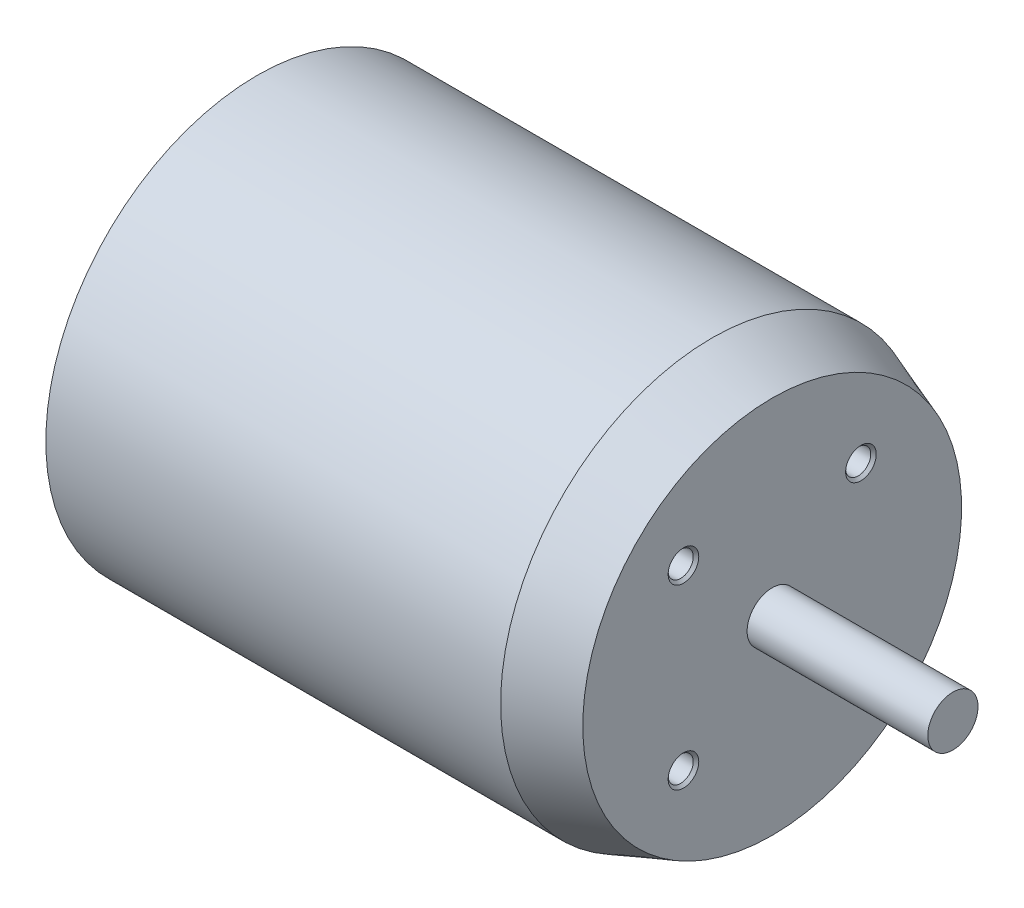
from build123d import *

# Parameters (mm, degrees)
R_P_TITION_CIRCULAIRE1_COUNT = 4


with BuildPart() as part:
    # Esquisse1 → R_volution1 (revolve)
    with BuildSketch(Plane.XY, mode=Mode.PRIVATE) as r_volution1_sk:
        Polygon((7, 5.5), (7, 21.05), (52.3, 21.05), (58.3, 18.866178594), (58.3, 2.5), (76.3, 2.5), (76.3, 0), (0, 0), (0, 5.5), align=None)
    revolve(r_volution1_sk.sketch.rotate(Axis((-55.117731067, 0, 0), (1, 0, 0)), 180), axis=Axis((-55.117731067, 0, 0), (1, 0, 0)))

    # Esquisse4 → Trou taraud_ M41 _position _ v_rifier (revolve, cut)
    with BuildSketch(Plane(origin=(58.3, 8.838834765, -8.838834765), x_dir=(0, 0, -1), z_dir=(0, 1, 0))):
        Polygon((0, 0), (0, 9.251075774), (1.25, 8.5), (1.25, 0.275), (1.525, 0), align=None)
    trou_taraud_m41_position_v_rifier = revolve(axis=Axis((64.65, 8.838834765, -8.838834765), (-1, 0, 0)), mode=Mode.SUBTRACT)

    # R_p_tition circulaire1: Trou taraud_ M41 _position _ v_rifier ×4 about axis
    r_p_tition_circulaire1_axis = Axis((0, 0, 0), (1, 0, 0))
    for i in range(1, R_P_TITION_CIRCULAIRE1_COUNT):
        add(trou_taraud_m41_position_v_rifier.rotate(r_p_tition_circulaire1_axis, i * 360 / R_P_TITION_CIRCULAIRE1_COUNT), mode=Mode.SUBTRACT)


solid = part.part
